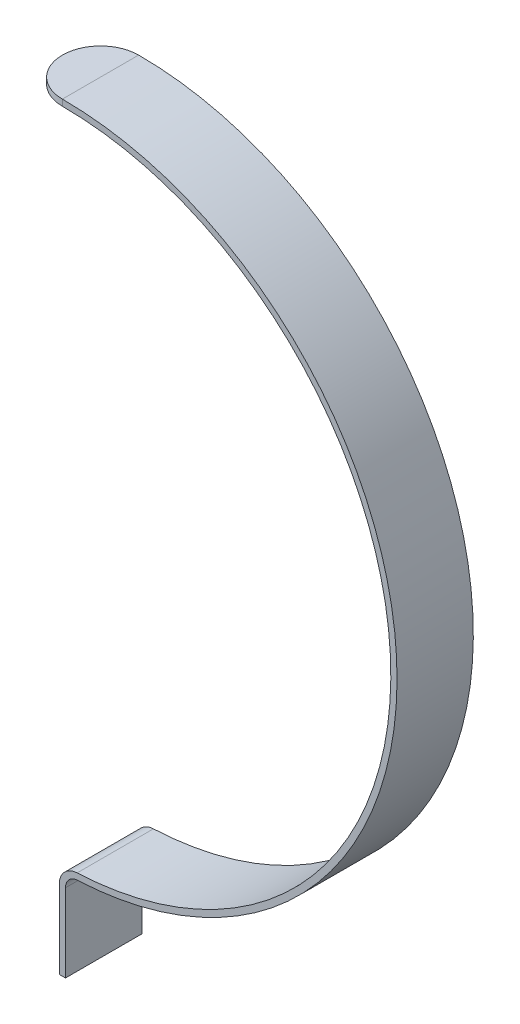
from build123d import *

# Parameters (mm, degrees)
SKETCH2_W           = 0.508
SKETCH2_H           = 6.223
SKETCH3_W           = 3.1115
SKETCH3_H           = 0.508
BOSS_REVOLVE1_ANGLE = 180


with BuildPart() as part:
    # Base-Sweep: sweep along a path in Sketch1
    with BuildLine(Plane.XY) as base_sweep_path:
        Line((0, -7.62), (0, -1.241510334))
        ThreePointArc((0, -1.241510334), (0.352060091, -0.363850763), (1.213049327, 0.027212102))
        ThreePointArc((1.213049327, 0.027212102), (27.044196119, 27.657677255), (0, 54.102))
    # Sketch2 → Base-Sweep (sweep)
    with BuildSketch(Plane(origin=(0, -7.62, 0), x_dir=(-1, 0, 0), z_dir=(0, 1, 0))):
        Rectangle(SKETCH2_W, SKETCH2_H)
    sweep(path=base_sweep_path.line)

    # Sketch3 → Boss-Revolve1 (revolve)
    with BuildSketch(Plane.ZY):
        with Locations((-1.55575, 54.102)):
            Rectangle(SKETCH3_W, SKETCH3_H)
    revolve(axis=Axis((0, 54.919888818, 0), (0, 1, 0)), revolution_arc=BOSS_REVOLVE1_ANGLE)


solid = part.part
